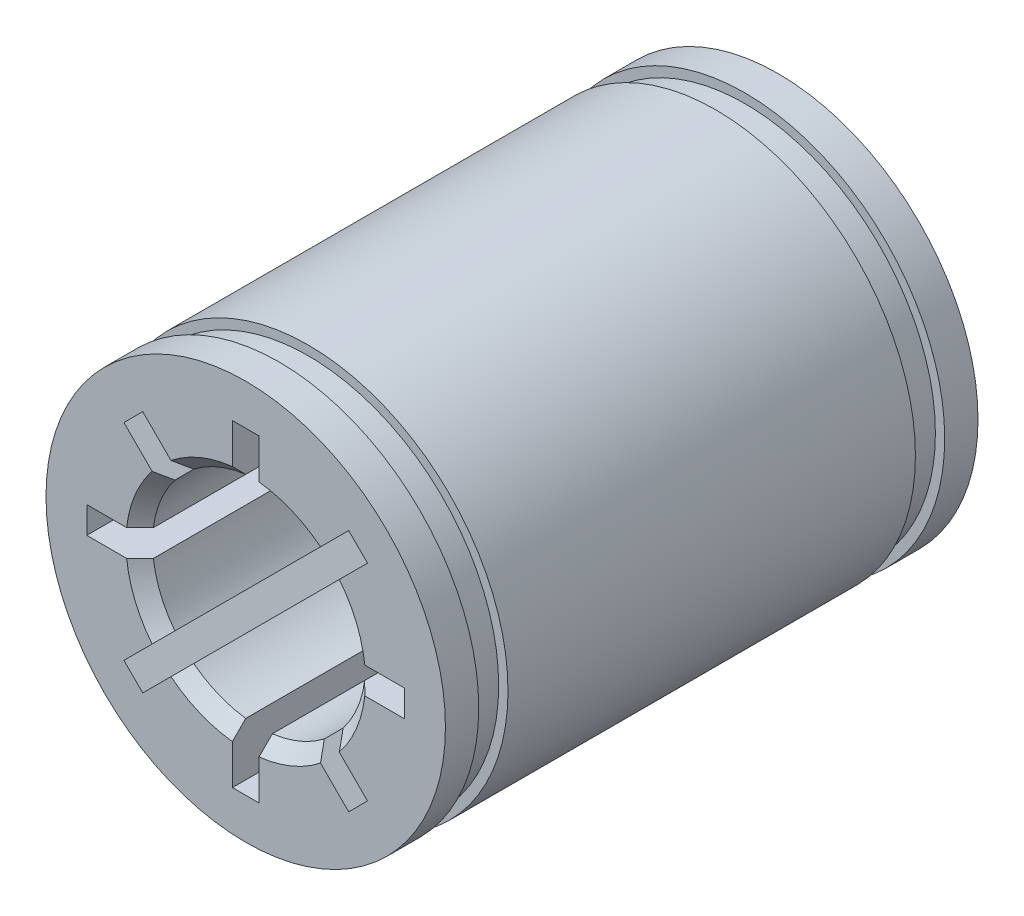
from build123d import *

# Parameters (mm, degrees)
ESQUISSE1_R        = 7.5
BOSS_EXTRU_1_DEPTH = 10
ESQUISSE2_W        = 1.1
ESQUISSE2_H        = 0.35
CHANFREIN3_SIZE    = 0.5


with BuildPart() as part:
    # Esquisse1 → Boss.-Extru.1 (new, symmetric)
    with BuildSketch(Plane.XY):
        Circle(ESQUISSE1_R)
        with BuildLine():
            Line((3.866903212, 4.574009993), (2.452689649, 3.159796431))
            ThreePointArc((2.452689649, 3.159796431), (1.530733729, 3.69551813), (0.5, 3.968626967))
            Line((0.5, 3.968626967), (0.5, 5.968626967))
            Line((0.5, 5.968626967), (-0.5, 5.968626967))
            Line((-0.5, 5.968626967), (-0.5, 3.968626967))
            ThreePointArc((-0.5, 3.968626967), (-1.530733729, 3.69551813), (-2.452689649, 3.159796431))
            Line((-2.452689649, 3.159796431), (-3.866903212, 4.574009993))
            Line((-3.866903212, 4.574009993), (-4.574009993, 3.866903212))
            Line((-4.574009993, 3.866903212), (-3.159796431, 2.452689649))
            ThreePointArc((-3.159796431, 2.452689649), (-3.69551813, 1.530733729), (-3.968626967, 0.5))
            Line((-3.968626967, 0.5), (-5.968626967, 0.5))
            Line((-5.968626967, 0.5), (-5.968626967, -0.5))
            Line((-5.968626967, -0.5), (-3.968626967, -0.5))
            ThreePointArc((-3.968626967, -0.5), (-3.69551813, -1.530733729), (-3.159796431, -2.452689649))
            Line((-3.159796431, -2.452689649), (-4.574009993, -3.866903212))
            Line((-4.574009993, -3.866903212), (-3.866903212, -4.574009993))
            Line((-3.866903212, -4.574009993), (-2.452689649, -3.159796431))
            ThreePointArc((-2.452689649, -3.159796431), (-1.530733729, -3.69551813), (-0.5, -3.968626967))
            Line((-0.5, -3.968626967), (-0.5, -5.968626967))
            Line((-0.5, -5.968626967), (0.5, -5.968626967))
            Line((0.5, -5.968626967), (0.5, -3.968626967))
            ThreePointArc((0.5, -3.968626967), (1.530733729, -3.69551813), (2.452689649, -3.159796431))
            Line((2.452689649, -3.159796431), (3.866903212, -4.574009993))
            Line((3.866903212, -4.574009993), (4.574009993, -3.866903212))
            Line((4.574009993, -3.866903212), (3.159796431, -2.452689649))
            ThreePointArc((3.159796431, -2.452689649), (3.69551813, -1.530733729), (3.968626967, -0.5))
            Line((3.968626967, -0.5), (5.968626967, -0.5))
            Line((5.968626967, -0.5), (5.968626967, 0.5))
            Line((5.968626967, 0.5), (3.968626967, 0.5))
            ThreePointArc((3.968626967, 0.5), (3.69551813, 1.530733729), (3.159796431, 2.452689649))
            Line((3.159796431, 2.452689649), (4.574009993, 3.866903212))
            Line((4.574009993, 3.866903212), (3.866903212, 4.574009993))
        make_face(mode=Mode.SUBTRACT)
    extrude(amount=BOSS_EXTRU_1_DEPTH, both=True)

    # Esquisse2 → Enl_vement de mati_re-R_volution1 (revolve, cut)
    with BuildSketch(Plane(origin=(0, 0, 0), x_dir=(0, 0, -1), z_dir=(1, 0, 0)), mode=Mode.PRIVATE) as enl_vement_de_mati_re_r_volution1_sk:
        with Locations((-8.2, 7.325)):
            Rectangle(ESQUISSE2_W, ESQUISSE2_H)
        with Locations((8.2, 7.325)):
            Rectangle(ESQUISSE2_W, ESQUISSE2_H)
    revolve(enl_vement_de_mati_re_r_volution1_sk.sketch.rotate(Axis((0, 0, 10), (0, 0, -1)), 90), axis=Axis((0, 0, 10), (0, 0, -1)), mode=Mode.SUBTRACT)

    # Chanfrein3
    chanfrein3_edges = [part.edges().sort_by_distance(p)[0] for p in [
        (-1.530733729, 3.69551813, -10),
        (-3.69551813, 1.530733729, -10),
        (-3.69551813, -1.530733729, -10),
        (-1.530733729, -3.69551813, -10),
        (1.530733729, -3.69551813, -10),
        (3.69551813, -1.530733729, -10),
        (3.69551813, 1.530733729, -10),
        (1.530733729, 3.69551813, -10),
        (-1.530733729, 3.69551813, 10),
        (-3.69551813, 1.530733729, 10),
        (-3.69551813, -1.530733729, 10),
        (-1.530733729, -3.69551813, 10),
        (1.530733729, -3.69551813, 10),
        (3.69551813, -1.530733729, 10),
        (3.69551813, 1.530733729, 10),
        (1.530733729, 3.69551813, 10),
    ]]
    chamfer(chanfrein3_edges, length=CHANFREIN3_SIZE)


solid = part.part
